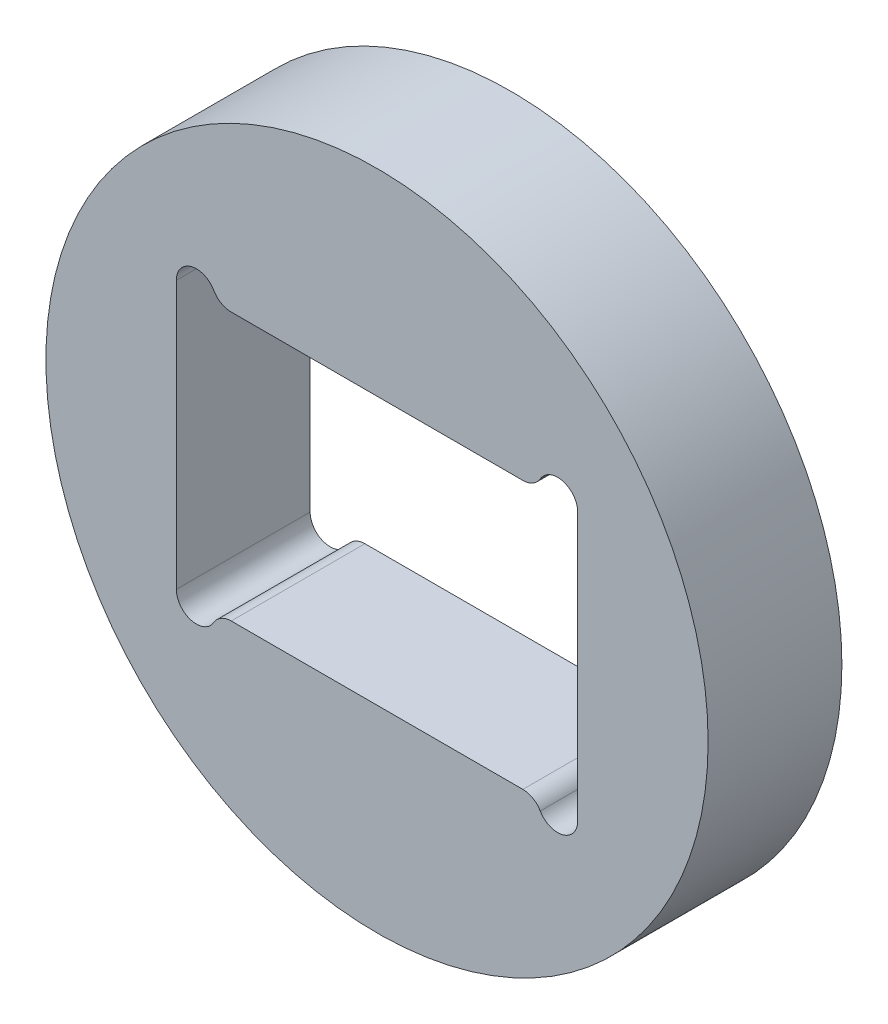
from build123d import *

# Parameters (mm, degrees)
ESQUISSE1_R        = 24.75
BOSS_EXTRU_1_DEPTH = 10


with BuildPart() as part:
    # Esquisse1 → Boss.-Extru.1 (new body)
    with BuildSketch(Plane.XY):
        Circle(ESQUISSE1_R)
        with BuildLine():
            Line((-10.901923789, 10), (10.901923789, 10))
            ThreePointArc((10.901923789, 10), (11.651923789, 10.200961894), (12.200961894, 10.75))
            ThreePointArc((12.200961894, 10.75), (13.888228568, 11.448888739), (15, 10))
            Line((15, 10), (15, -10))
            ThreePointArc((15, -10), (13.888228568, -11.448888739), (12.200961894, -10.75))
            ThreePointArc((12.200961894, -10.75), (11.651923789, -10.200961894), (10.901923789, -10))
            Line((10.901923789, -10), (-10.901923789, -10))
            ThreePointArc((-10.901923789, -10), (-11.651923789, -10.200961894), (-12.200961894, -10.75))
            ThreePointArc((-12.200961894, -10.75), (-13.888228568, -11.448888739), (-15, -10))
            Line((-15, -10), (-15, 10))
            ThreePointArc((-15, 10), (-13.888228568, 11.448888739), (-12.200961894, 10.75))
            ThreePointArc((-12.200961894, 10.75), (-11.651923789, 10.200961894), (-10.901923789, 10))
        make_face(mode=Mode.SUBTRACT)
    extrude(amount=BOSS_EXTRU_1_DEPTH)


solid = part.part
